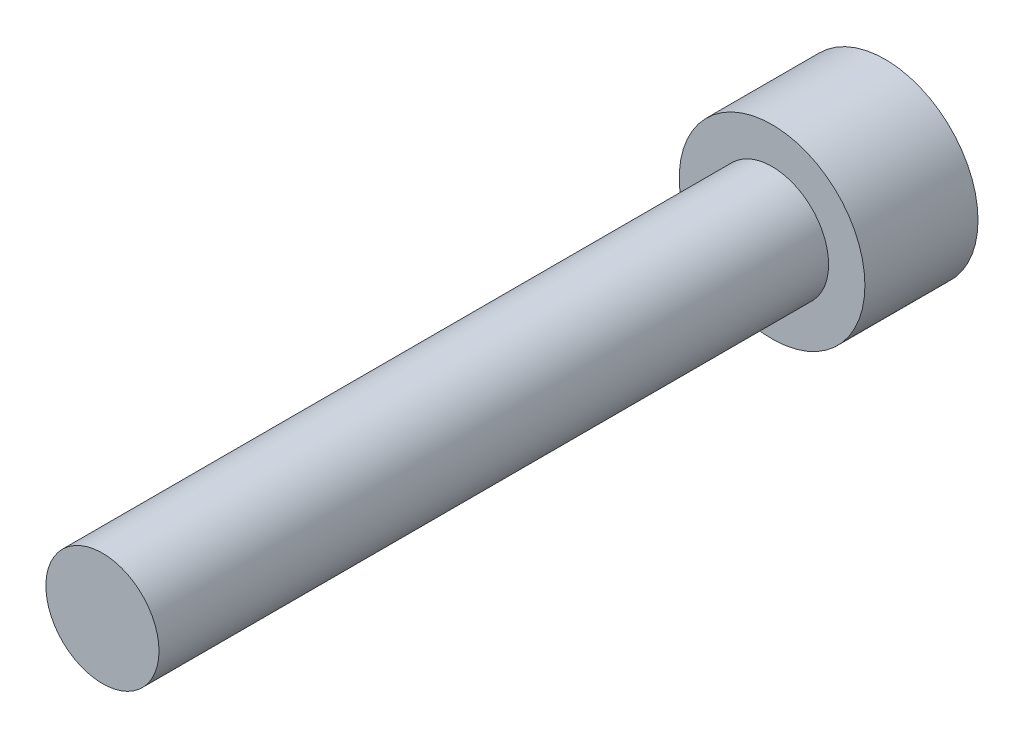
from build123d import *

# Parameters (mm, degrees)
HEX_2_DEPTH = 3.048


with BuildPart() as part:
    # Sketch6 → Revolve1 (revolve)
    with BuildSketch(Plane(origin=(0, 0, 0), x_dir=(0, 0, -1), z_dir=(1, 0, 0)), mode=Mode.PRIVATE) as revolve1_sk:
        Polygon((-28.575, 0), (-28.575, -2.413), (0, -2.413), (0, -3.9624), (4.826, -3.9624), (4.826, 0), align=None)
    revolve(revolve1_sk.sketch.rotate(Axis((0, 0, 28.575), (0, 0, -1)), 270), axis=Axis((0, 0, 28.575), (0, 0, -1)))

    # Sketch7 → HEX 2 (cut)
    with BuildSketch(Plane(origin=(0, 0, -4.826), x_dir=(-1, 0, 0), z_dir=(0, 0, -1))):
        Polygon((-1.9812, 1.143846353), (-1.9812, -1.143846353), (0, -2.287692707), (1.9812, -1.143846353), (1.9812, 1.143846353), (0, 2.287692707), align=None)
    extrude(amount=-HEX_2_DEPTH, mode=Mode.SUBTRACT)


solid = part.part
